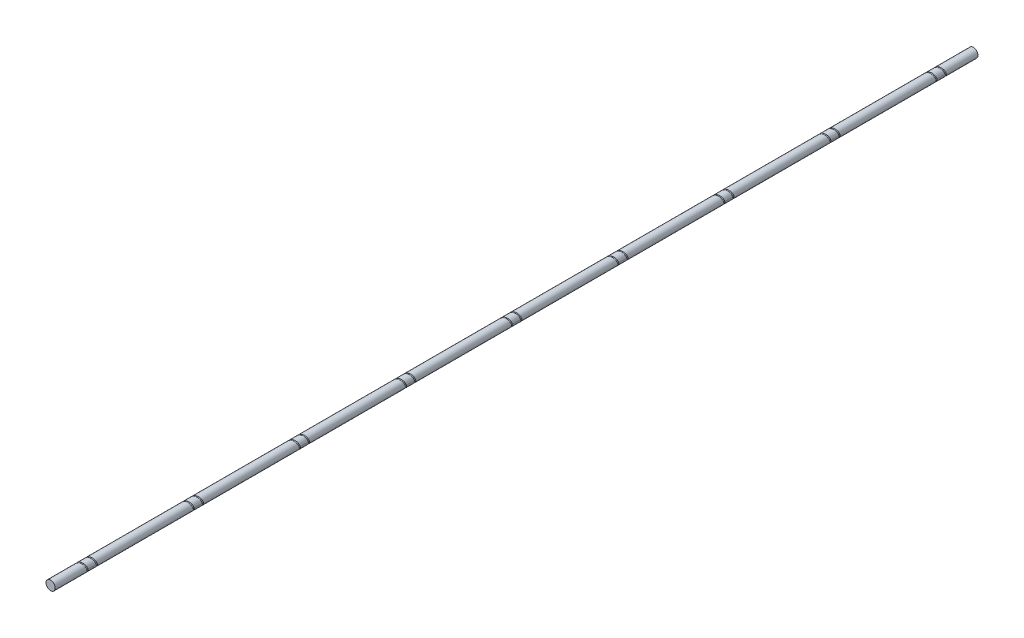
from build123d import *

# Parameters (mm, degrees)
SKETCH1_R              = 25
BOSS_EXTRUDE1_DEPTH    = 5000
CUT_SWEEP1_PITCH       = 50
CUT_SWEEP1_HEIGHT      = 100
CUT_SWEEP1_RADIUS      = 27.646
CUT_SWEEP1_START_ANGLE = -180
SKETCH3_R              = 3.969
LPATTERN1_COUNT        = 9
LPATTERN1_PITCH        = 575


with BuildPart() as part:
    # Sketch1 → Boss-Extrude1 (new body)
    with BuildSketch(Plane.XY):
        Circle(SKETCH1_R)
    extrude(amount=BOSS_EXTRUDE1_DEPTH)

    # Cut-Sweep1: sweep along a helix
    with BuildLine() as cut_sweep1_path:
        add(Helix(CUT_SWEEP1_PITCH, CUT_SWEEP1_HEIGHT, CUT_SWEEP1_RADIUS, center=(0, 0, 150), direction=(0, 0, 1), mode=Mode.PRIVATE).rotate(Axis((0, 0, 150), (0, 0, 1)), CUT_SWEEP1_START_ANGLE))
    # Sketch3 → Cut-Sweep1 (sweep, cut)
    with BuildSketch(Plane(origin=(0, 0, 0), x_dir=(1, 0, 0), z_dir=(0, 1, 0))):
        with Locations((-27.646, -150)):
            Circle(SKETCH3_R)
    cut_sweep1 = sweep(path=cut_sweep1_path.line, is_frenet=True, mode=Mode.SUBTRACT)

    # LPattern1: Cut-Sweep1 ×9
    with Locations(*[(0, 0, i * LPATTERN1_PITCH) for i in range(1, LPATTERN1_COUNT)]):
        add(cut_sweep1, mode=Mode.SUBTRACT)


solid = part.part
